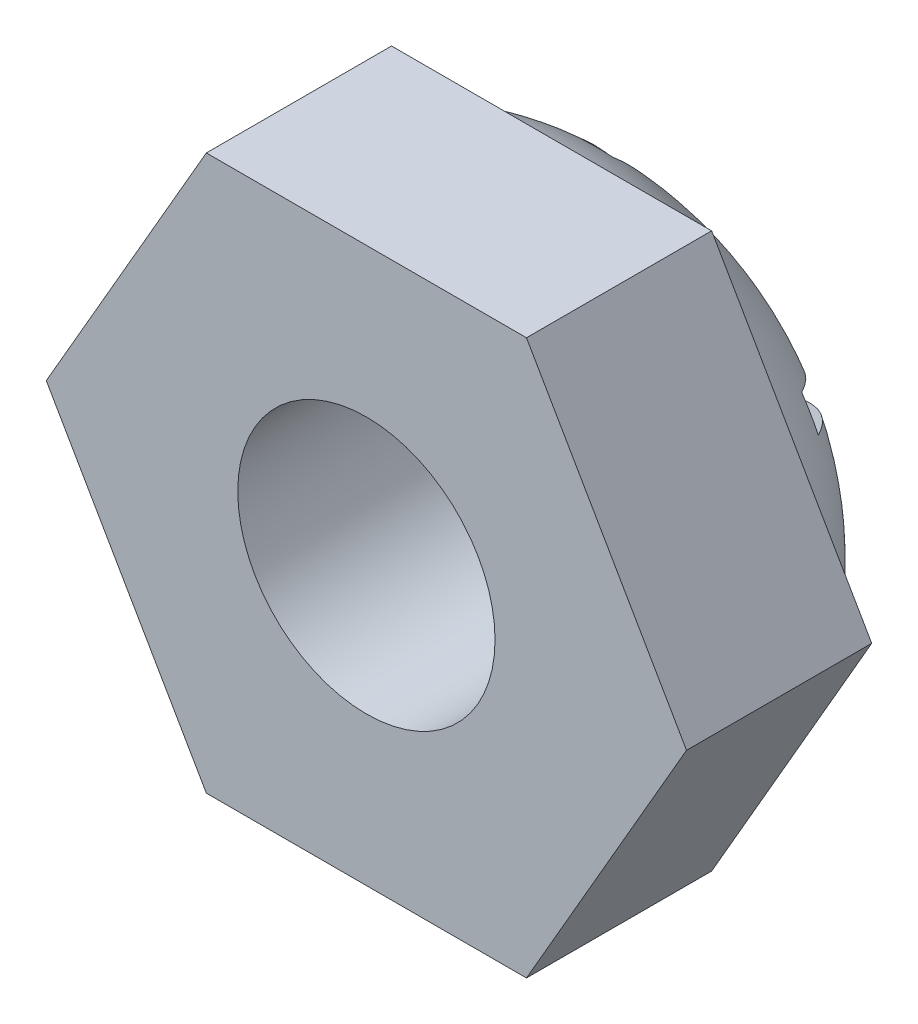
from build123d import *

# Parameters (mm, degrees)
BOSS_EXTRUDE1_DEPTH   = 2.1209
F_4_CLEARANCE_HOLE1_D = 2.9464
SKETCH5_W             = 0.381
SKETCH5_H             = 3.764882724
CUT_EXTRUDE1_DEPTH    = 6.516572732
CIRPATTERN1_COUNT     = 6


with BuildPart() as part:
    # Sketch1 → Boss-Extrude1 (new body)
    with BuildSketch(Plane.XY):
        Polygon((1.833087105, 3.175), (-1.833087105, 3.175), (-3.666174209, 0), (-1.833087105, -3.175), (1.833087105, -3.175), (3.666174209, 0), align=None)
    extrude(amount=BOSS_EXTRUDE1_DEPTH)

    # Sketch2 → Revolve1 (revolve)
    with BuildSketch(Plane(origin=(0, 0, 0), x_dir=(1, 0, 0), z_dir=(0, 1, 0))):
        with BuildLine():
            Line((0, 0), (-3.175, 0))
            add(Edge.make_bspline(
                [(-3.175, 0), (-2.394504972, 1.510165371), (0, 1.778)],
                knots=[0, 0, 0, 1, 1, 1], degree=2))
            Line((0, 1.778), (0, 0))
        make_face()
    revolve(axis=Axis((0, 0, -1.778), (0, 0, 1)))

    # 4 Clearance Hole1 (through all)
    with Locations(Plane.XY.offset(2.1209)):
        with Locations((0, 0)):
            Hole(F_4_CLEARANCE_HOLE1_D / 2)

    # Sketch5 → Cut-Extrude1 (cut, through all)
    with BuildSketch(Plane(origin=(0, 0, -0.508), x_dir=(-1, 0, 0), z_dir=(0, 0, -1))):
        with Locations((0, 1.882441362)):
            Rectangle(SKETCH5_W, SKETCH5_H)
    cut_extrude1 = extrude(amount=CUT_EXTRUDE1_DEPTH, mode=Mode.SUBTRACT)

    # CirPattern1: Cut-Extrude1 ×6 about axis
    cirpattern1_axis = Axis((0, 0, 0), (0, 0, 1))
    for i in range(1, CIRPATTERN1_COUNT):
        add(cut_extrude1.rotate(cirpattern1_axis, i * 360 / CIRPATTERN1_COUNT), mode=Mode.SUBTRACT)


solid = part.part
